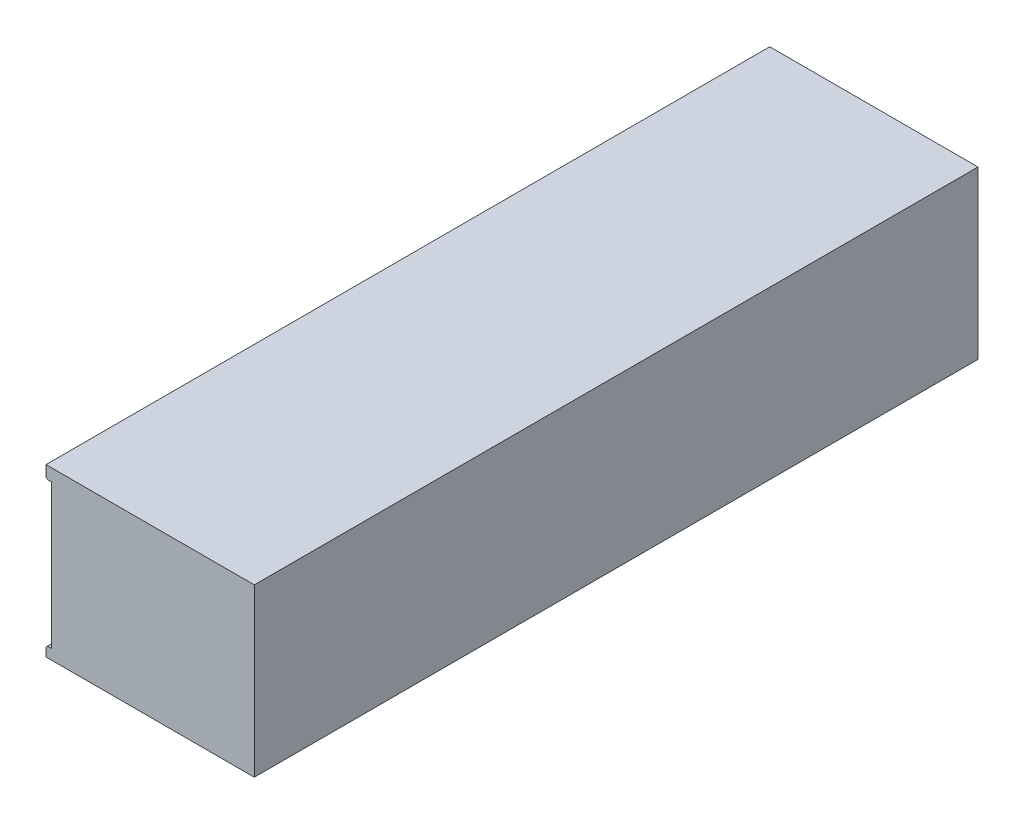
from build123d import *

# Parameters (mm, degrees)
EXTRUDE1_DEPTH                   = 90.4748
F_10_32_TAPPED_HOLE1_D           = 4.0386
F_10_32_TAPPED_HOLE1_DEPTH       = 9.99744
F_10_32_TAPPED_HOLE1_CBORE_D     = 4.826
F_10_32_TAPPED_HOLE1_CBORE_DEPTH = 7.62
F_10_32_TAPPED_HOLE1_TIP         = 1.213317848
CHAMFER1_SIZE                    = 0.381


with BuildPart() as part:
    # Sketch1 → Extrude1 (new, symmetric)
    with BuildSketch(Plane.XY):
        Polygon((50.673, 0), (50.673, -41.656), (-1.397, -41.656), (-1.397, -39.116), (0, -39.116), (0, -3.048), (-1.397, -3.048), (-1.397, 0), align=None)
    extrude(amount=EXTRUDE1_DEPTH, both=True)

    # 10-32 Tapped Hole1
    with Locations(Plane(origin=(0, -6.35, -85.598), x_dir=(0, 0, -1), z_dir=(-1, 0, 0))):
        with Locations((0, 0), (-171.196, 0), (-90.4748, 0), (-80.7212, 0), (0, 29.464), (-80.7212, 29.464), (-90.4748, 29.464), (-171.196, 29.464)):
            CounterBoreHole(F_10_32_TAPPED_HOLE1_D / 2, F_10_32_TAPPED_HOLE1_CBORE_D / 2, F_10_32_TAPPED_HOLE1_CBORE_DEPTH, depth=F_10_32_TAPPED_HOLE1_DEPTH)
            with Locations((0, 0, -(F_10_32_TAPPED_HOLE1_DEPTH + F_10_32_TAPPED_HOLE1_TIP / 2))):  # 118° drill point
                Cone(0, F_10_32_TAPPED_HOLE1_D / 2, F_10_32_TAPPED_HOLE1_TIP, mode=Mode.SUBTRACT)

    # Chamfer1
    chamfer1_edges = [part.edges().sort_by_distance(p)[0] for p in [
        (-1.397, -39.116, 0),
        (-1.397, -3.048, 0),
    ]]
    chamfer(chamfer1_edges, length=CHAMFER1_SIZE)


solid = part.part
